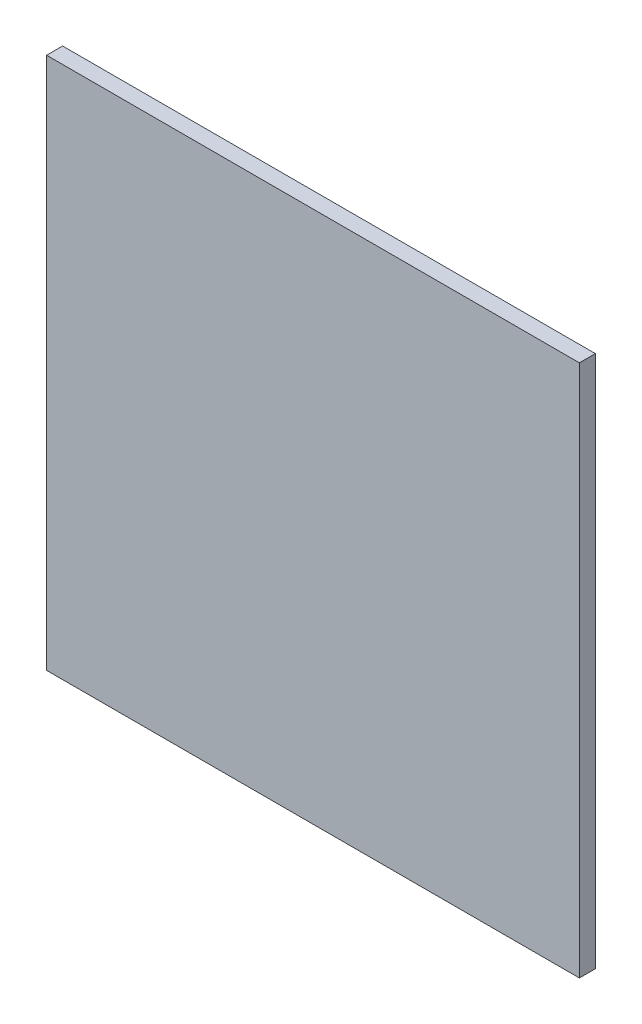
ISO-10303-21;
HEADER;
FILE_DESCRIPTION(('STEP AP214'),'2;1');
FILE_NAME('part.step','',(''),(''),'','','');
FILE_SCHEMA(('AUTOMOTIVE_DESIGN { 1 0 10303 214 1 1 1 1 }'));
ENDSEC;
DATA;
#1=APPLICATION_CONTEXT('core data for automotive mechanical design processes');
#2=APPLICATION_PROTOCOL_DEFINITION('international standard','automotive_design',2000,#1);
#3=PRODUCT_CONTEXT('',#1,'mechanical');
#4=PRODUCT('Part','Part','',(#3));
#5=PRODUCT_RELATED_PRODUCT_CATEGORY('part','',(#4));
#6=PRODUCT_DEFINITION_FORMATION('','',#4);
#7=PRODUCT_DEFINITION_CONTEXT('part definition',#1,'design');
#8=PRODUCT_DEFINITION('design','',#6,#7);
#9=PRODUCT_DEFINITION_SHAPE('','',#8);
#10=(LENGTH_UNIT() NAMED_UNIT(*) SI_UNIT(.MILLI.,.METRE.));
#11=(NAMED_UNIT(*) PLANE_ANGLE_UNIT() SI_UNIT($,.RADIAN.));
#12=(NAMED_UNIT(*) SI_UNIT($,.STERADIAN.) SOLID_ANGLE_UNIT());
#13=UNCERTAINTY_MEASURE_WITH_UNIT(LENGTH_MEASURE(1.E-05),#10,'distance_accuracy_value','');
#14=(GEOMETRIC_REPRESENTATION_CONTEXT(3) GLOBAL_UNCERTAINTY_ASSIGNED_CONTEXT((#13)) GLOBAL_UNIT_ASSIGNED_CONTEXT((#10,
#11,#12)) REPRESENTATION_CONTEXT('',''));
#15=CARTESIAN_POINT('',(0.,0.,0.));
#16=DIRECTION('',(0.,0.,1.));
#17=DIRECTION('',(1.,0.,0.));
#18=AXIS2_PLACEMENT_3D('',#15,#16,#17);
#19=CARTESIAN_POINT('',(-250.,250.,15.));
#20=DIRECTION('',(1.,0.,0.));
#21=DIRECTION('',(0.,1.,0.));
#22=AXIS2_PLACEMENT_3D('',#19,#20,#21);
#23=PLANE('',#22);
#24=DIRECTION('',(0.,-1.,0.));
#25=VECTOR('',#24,1.);
#26=CARTESIAN_POINT('',(-250.,250.,0.));
#27=LINE('',#26,#25);
#28=CARTESIAN_POINT('',(-250.,250.,0.));
#29=VERTEX_POINT('',#28);
#30=CARTESIAN_POINT('',(-250.,-250.,0.));
#31=VERTEX_POINT('',#30);
#32=EDGE_CURVE('E111',#29,#31,#27,.T.);
#33=ORIENTED_EDGE('',*,*,#32,.T.);
#34=DIRECTION('',(0.,0.,-1.));
#35=VECTOR('',#34,1.);
#36=CARTESIAN_POINT('',(-250.,-250.,15.));
#37=LINE('',#36,#35);
#38=CARTESIAN_POINT('',(-250.,-250.,15.));
#39=VERTEX_POINT('',#38);
#40=EDGE_CURVE('E11',#39,#31,#37,.T.);
#41=ORIENTED_EDGE('',*,*,#40,.F.);
#42=DIRECTION('',(0.,-1.,0.));
#43=VECTOR('',#42,1.);
#44=CARTESIAN_POINT('',(-250.,250.,15.));
#45=LINE('',#44,#43);
#46=CARTESIAN_POINT('',(-250.,250.,15.));
#47=VERTEX_POINT('',#46);
#48=EDGE_CURVE('E95',#47,#39,#45,.T.);
#49=ORIENTED_EDGE('',*,*,#48,.F.);
#50=DIRECTION('',(0.,0.,-1.));
#51=VECTOR('',#50,1.);
#52=CARTESIAN_POINT('',(-250.,250.,15.));
#53=LINE('',#52,#51);
#54=EDGE_CURVE('E107',#47,#29,#53,.T.);
#55=ORIENTED_EDGE('',*,*,#54,.T.);
#56=EDGE_LOOP('',(#33,#41,#49,#55));
#57=FACE_BOUND('',#56,.T.);
#58=ADVANCED_FACE('F43',(#57),#23,.F.);
#59=CARTESIAN_POINT('',(250.,-250.,15.));
#60=DIRECTION('',(0.,1.,0.));
#61=DIRECTION('',(-1.,0.,0.));
#62=AXIS2_PLACEMENT_3D('',#59,#60,#61);
#63=PLANE('',#62);
#64=DIRECTION('',(1.,0.,0.));
#65=VECTOR('',#64,1.);
#66=CARTESIAN_POINT('',(250.,-250.,0.));
#67=LINE('',#66,#65);
#68=CARTESIAN_POINT('',(250.,-250.,0.));
#69=VERTEX_POINT('',#68);
#70=EDGE_CURVE('E100',#31,#69,#67,.T.);
#71=ORIENTED_EDGE('',*,*,#70,.T.);
#72=DIRECTION('',(0.,0.,-1.));
#73=VECTOR('',#72,1.);
#74=CARTESIAN_POINT('',(250.,-250.,15.));
#75=LINE('',#74,#73);
#76=CARTESIAN_POINT('',(250.,-250.,15.));
#77=VERTEX_POINT('',#76);
#78=EDGE_CURVE('E52',#77,#69,#75,.T.);
#79=ORIENTED_EDGE('',*,*,#78,.F.);
#80=DIRECTION('',(1.,0.,0.));
#81=VECTOR('',#80,1.);
#82=CARTESIAN_POINT('',(250.,-250.,15.));
#83=LINE('',#82,#81);
#84=EDGE_CURVE('E90',#39,#77,#83,.T.);
#85=ORIENTED_EDGE('',*,*,#84,.F.);
#86=ORIENTED_EDGE('',*,*,#40,.T.);
#87=EDGE_LOOP('',(#71,#79,#85,#86));
#88=FACE_BOUND('',#87,.T.);
#89=ADVANCED_FACE('F99',(#88),#63,.F.);
#90=CARTESIAN_POINT('',(250.,250.,15.));
#91=DIRECTION('',(-1.,0.,0.));
#92=DIRECTION('',(0.,-1.,0.));
#93=AXIS2_PLACEMENT_3D('',#90,#91,#92);
#94=PLANE('',#93);
#95=DIRECTION('',(0.,1.,0.));
#96=VECTOR('',#95,1.);
#97=CARTESIAN_POINT('',(250.,250.,0.));
#98=LINE('',#97,#96);
#99=CARTESIAN_POINT('',(250.,250.,0.));
#100=VERTEX_POINT('',#99);
#101=EDGE_CURVE('E77',#69,#100,#98,.T.);
#102=ORIENTED_EDGE('',*,*,#101,.T.);
#103=DIRECTION('',(0.,0.,-1.));
#104=VECTOR('',#103,1.);
#105=CARTESIAN_POINT('',(250.,250.,15.));
#106=LINE('',#105,#104);
#107=CARTESIAN_POINT('',(250.,250.,15.));
#108=VERTEX_POINT('',#107);
#109=EDGE_CURVE('E102',#108,#100,#106,.T.);
#110=ORIENTED_EDGE('',*,*,#109,.F.);
#111=DIRECTION('',(0.,1.,0.));
#112=VECTOR('',#111,1.);
#113=CARTESIAN_POINT('',(250.,250.,15.));
#114=LINE('',#113,#112);
#115=EDGE_CURVE('E93',#77,#108,#114,.T.);
#116=ORIENTED_EDGE('',*,*,#115,.F.);
#117=ORIENTED_EDGE('',*,*,#78,.T.);
#118=EDGE_LOOP('',(#102,#110,#116,#117));
#119=FACE_BOUND('',#118,.T.);
#120=ADVANCED_FACE('F103',(#119),#94,.F.);
#121=CARTESIAN_POINT('',(250.,250.,15.));
#122=DIRECTION('',(0.,-1.,0.));
#123=DIRECTION('',(1.,0.,0.));
#124=AXIS2_PLACEMENT_3D('',#121,#122,#123);
#125=PLANE('',#124);
#126=DIRECTION('',(-1.,0.,0.));
#127=VECTOR('',#126,1.);
#128=CARTESIAN_POINT('',(250.,250.,0.));
#129=LINE('',#128,#127);
#130=EDGE_CURVE('E83',#100,#29,#129,.T.);
#131=ORIENTED_EDGE('',*,*,#130,.T.);
#132=ORIENTED_EDGE('',*,*,#54,.F.);
#133=DIRECTION('',(-1.,0.,0.));
#134=VECTOR('',#133,1.);
#135=CARTESIAN_POINT('',(250.,250.,15.));
#136=LINE('',#135,#134);
#137=EDGE_CURVE('E60',#108,#47,#136,.T.);
#138=ORIENTED_EDGE('',*,*,#137,.F.);
#139=ORIENTED_EDGE('',*,*,#109,.T.);
#140=EDGE_LOOP('',(#131,#132,#138,#139));
#141=FACE_BOUND('',#140,.T.);
#142=ADVANCED_FACE('F124',(#141),#125,.F.);
#143=CARTESIAN_POINT('',(0.,0.,15.));
#144=DIRECTION('',(0.,0.,-1.));
#145=DIRECTION('',(-1.,0.,0.));
#146=AXIS2_PLACEMENT_3D('',#143,#144,#145);
#147=PLANE('',#146);
#148=ORIENTED_EDGE('',*,*,#48,.T.);
#149=ORIENTED_EDGE('',*,*,#84,.T.);
#150=ORIENTED_EDGE('',*,*,#115,.T.);
#151=ORIENTED_EDGE('',*,*,#137,.T.);
#152=EDGE_LOOP('',(#148,#149,#150,#151));
#153=FACE_BOUND('',#152,.T.);
#154=ADVANCED_FACE('F91',(#153),#147,.F.);
#155=CARTESIAN_POINT('',(0.,0.,0.));
#156=DIRECTION('',(0.,0.,-1.));
#157=DIRECTION('',(-1.,0.,0.));
#158=AXIS2_PLACEMENT_3D('',#155,#156,#157);
#159=PLANE('',#158);
#160=ORIENTED_EDGE('',*,*,#32,.F.);
#161=ORIENTED_EDGE('',*,*,#130,.F.);
#162=ORIENTED_EDGE('',*,*,#101,.F.);
#163=ORIENTED_EDGE('',*,*,#70,.F.);
#164=EDGE_LOOP('',(#160,#161,#162,#163));
#165=FACE_BOUND('',#164,.T.);
#166=ADVANCED_FACE('F127',(#165),#159,.T.);
#167=CLOSED_SHELL('',(#58,#89,#120,#142,#154,#166));
#168=MANIFOLD_SOLID_BREP('B2',#167);
#169=ADVANCED_BREP_SHAPE_REPRESENTATION('',(#18,#168),#14);
#170=SHAPE_DEFINITION_REPRESENTATION(#9,#169);
ENDSEC;
END-ISO-10303-21;
